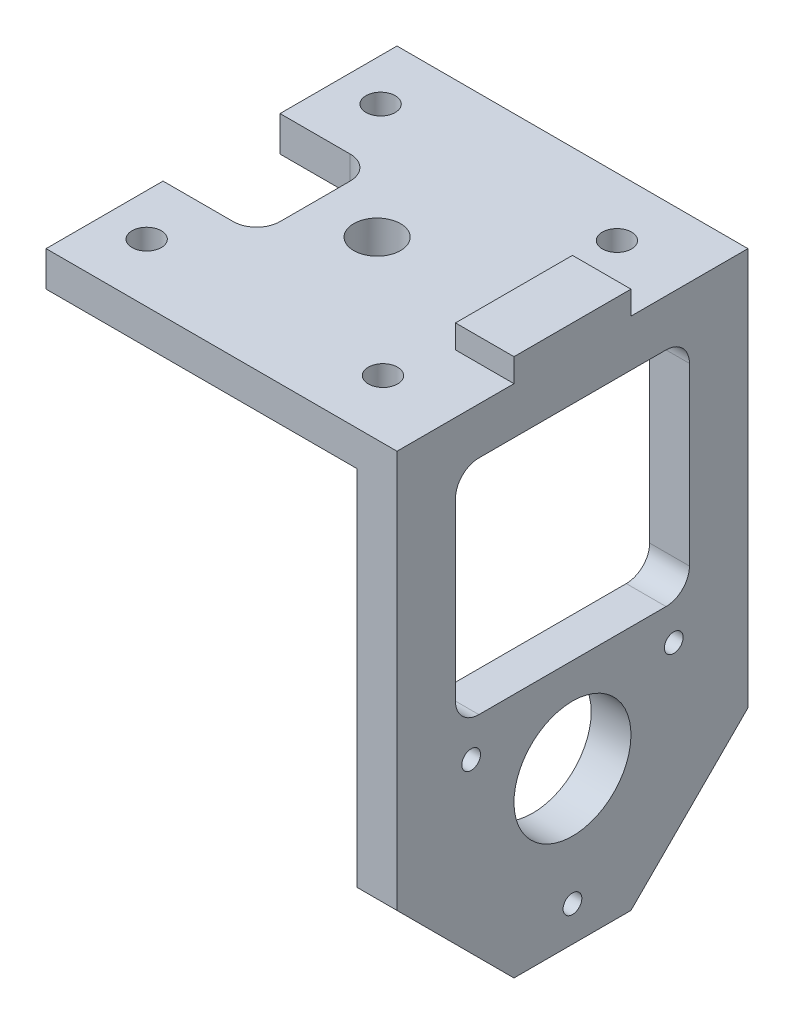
from build123d import *

# Parameters (mm, degrees)
EXTRUDE_1_DEPTH          = 30
CUT_EXTRUDE_1_REACH      = 61.699
SKETCH_2_R               = 5
SKETCH_2_W               = 20
SKETCH_2_H               = 19
HOLE_WIZARD_M2_1_D       = 1.6
PATTERN_CIRCULAR_1_COUNT = 3
FILLET_2_R               = 2
SKETCH_9_W               = 5
SKETCH_9_H               = 10
EXTRUDE_2_DEPTH          = 2
CUT_EXTRUDE_2_REACH      = 63.847
SKETCH_10_W              = 8
SKETCH_10_H              = 10
HOLE_WIZARD_M3_1_D       = 2.5
FILLET_3_R               = 2
SKETCH_15_W              = 35.309416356
SKETCH_15_H              = 3.437555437
CUT_EXTRUDE_3_DEPTH      = 10
CHAMFER_1_SIZE           = 10
SKETCH_16_R              = 2
CUT_EXTRUDE_4_DEPTH      = 10


with BuildPart() as part:
    # Sketch 1 → Extrude 1 (new body)
    with BuildSketch(Plane.XY):
        Polygon((0, 0), (26.6, 0), (26.6, -42), (30, -42), (30, 3), (0, 3), align=None)
    extrude(amount=-EXTRUDE_1_DEPTH)

    # Sketch 2 → Cut-Extrude 1 (cut, up to next)
    with BuildSketch(Plane(origin=(30, 0, 0), x_dir=(0, 0, -1), z_dir=(1, 0, 0)), mode=Mode.PRIVATE) as cut_extrude_1_sk1:
        with Locations(Location((15, -28, 0), (0, 0, 90))):
            Circle(SKETCH_2_R)
    cut_extrude_1_tool1 = extrude(cut_extrude_1_sk1.sketch, amount=-CUT_EXTRUDE_1_REACH, mode=Mode.PRIVATE) & part.part
    # Sketch 2 → Cut-Extrude 1 (cut, up to next)
    with BuildSketch(Plane(origin=(30, 0, 0), x_dir=(0, 0, -1), z_dir=(1, 0, 0)), mode=Mode.PRIVATE) as cut_extrude_1_sk2:
        with Locations((15, -10.5)):
            Rectangle(SKETCH_2_W, SKETCH_2_H)
    cut_extrude_1_tool2 = extrude(cut_extrude_1_sk2.sketch, amount=-CUT_EXTRUDE_1_REACH, mode=Mode.PRIVATE) & part.part
    add(cut_extrude_1_tool1.solids().sort_by_distance((30, -28, -15))[0], mode=Mode.SUBTRACT)
    add(cut_extrude_1_tool2.solids().sort_by_distance((30, -10.5, -15))[0], mode=Mode.SUBTRACT)

    # Hole Wizard M2 _1 (through all)
    with Locations(Plane(origin=(30, 0, 0), x_dir=(0, 0, -1), z_dir=(1, 0, 0))):
        with Locations((15, -38)):
            hole_wizard_m2_1 = Hole(HOLE_WIZARD_M2_1_D / 2)

    # Pattern Circular 1: Hole Wizard M2 _1 ×3 about axis
    pattern_circular_1_axis = Axis((0, -28, -15), (1, 0, 0))
    for i in range(1, PATTERN_CIRCULAR_1_COUNT):
        add(hole_wizard_m2_1.rotate(pattern_circular_1_axis, i * 360 / PATTERN_CIRCULAR_1_COUNT), mode=Mode.SUBTRACT)

    # Fillet 2
    fillet_2_edges = [part.edges().sort_by_distance(p)[0] for p in [
        (28.3, -1, -25),
        (28.3, -20, -25),
        (28.3, -20, -5),
        (28.3, -1, -5),
    ]]
    fillet(fillet_2_edges, radius=FILLET_2_R)

    # Sketch 9 → Extrude 2 (add)
    with BuildSketch(Plane(origin=(0, 3, 0), x_dir=(1, 0, 0), z_dir=(0, 1, 0))):
        with Locations((27.5, 15)):
            Rectangle(SKETCH_9_W, SKETCH_9_H)
    extrude(amount=EXTRUDE_2_DEPTH)

    # Sketch 10 → Cut-Extrude 2 (cut, up to next)
    with BuildSketch(Plane(origin=(0, 3, 0), x_dir=(1, 0, 0), z_dir=(0, 1, 0)), mode=Mode.PRIVATE) as cut_extrude_2_sk1:
        with Locations((4, 15)):
            Rectangle(SKETCH_10_W, SKETCH_10_H)
    cut_extrude_2_tool1 = extrude(cut_extrude_2_sk1.sketch, amount=-CUT_EXTRUDE_2_REACH, mode=Mode.PRIVATE) & part.part
    add(cut_extrude_2_tool1.solids().sort_by_distance((4, 3, -15))[0], mode=Mode.SUBTRACT)

    # Hole Wizard M3 _1 (through all)
    with Locations(Plane(origin=(0, 3, 0), x_dir=(1, 0, 0), z_dir=(0, 1, 0))):
        with Locations((23.8, 25), (3.6, 25)):
            hole_wizard_m3_1 = Hole(HOLE_WIZARD_M3_1_D / 2)

    # Mirror 1: Hole Wizard M3 _1 across plane
    add(hole_wizard_m3_1.mirror(Plane.XY.offset(-15)), mode=Mode.SUBTRACT)

    # Fillet 3
    fillet_3_edges = [part.edges().sort_by_distance(p)[0] for p in [
        (8, 1.5, -20),
        (8, 1.5, -10),
    ]]
    fillet(fillet_3_edges, radius=FILLET_3_R)

    # Sketch 15 → Cut-Extrude 3 (cut)
    with BuildSketch(Plane(origin=(30, 0, 0), x_dir=(0, 0, -1), z_dir=(1, 0, 0))):
        with Locations((15.284968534, -42.718777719)):
            Rectangle(SKETCH_15_W, SKETCH_15_H)
    extrude(amount=-CUT_EXTRUDE_3_DEPTH, mode=Mode.SUBTRACT)

    # Chamfer 1
    chamfer_1_edges = [part.edges().sort_by_distance(p)[0] for p in [
        (28.3, -41, 0),
        (28.3, -41, -30),
    ]]
    chamfer(chamfer_1_edges, length=CHAMFER_1_SIZE)

    # Sketch 16 → Cut-Extrude 4 (cut)
    with BuildSketch(Plane(origin=(0, 3, 0), x_dir=(1, 0, 0), z_dir=(0, 1, 0))):
        with Locations(Location((13.3, 15, 0), (0, 0, 270))):
            Circle(SKETCH_16_R)
    extrude(amount=-CUT_EXTRUDE_4_DEPTH, mode=Mode.SUBTRACT)


solid = part.part
